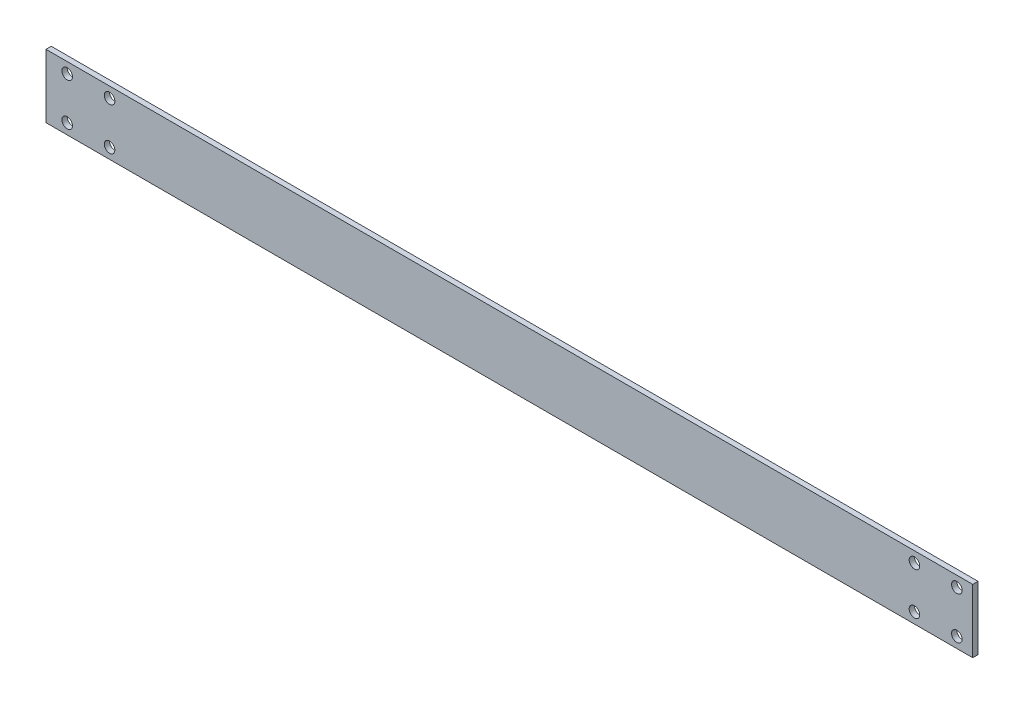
ISO-10303-21;
HEADER;
FILE_DESCRIPTION(('STEP AP214'),'2;1');
FILE_NAME('part.step','',(''),(''),'','','');
FILE_SCHEMA(('AUTOMOTIVE_DESIGN { 1 0 10303 214 1 1 1 1 }'));
ENDSEC;
DATA;
#1=APPLICATION_CONTEXT('core data for automotive mechanical design processes');
#2=APPLICATION_PROTOCOL_DEFINITION('international standard','automotive_design',2000,#1);
#3=PRODUCT_CONTEXT('',#1,'mechanical');
#4=PRODUCT('Part','Part','',(#3));
#5=PRODUCT_RELATED_PRODUCT_CATEGORY('part','',(#4));
#6=PRODUCT_DEFINITION_FORMATION('','',#4);
#7=PRODUCT_DEFINITION_CONTEXT('part definition',#1,'design');
#8=PRODUCT_DEFINITION('design','',#6,#7);
#9=PRODUCT_DEFINITION_SHAPE('','',#8);
#10=(LENGTH_UNIT() NAMED_UNIT(*) SI_UNIT(.MILLI.,.METRE.));
#11=(NAMED_UNIT(*) PLANE_ANGLE_UNIT() SI_UNIT($,.RADIAN.));
#12=(NAMED_UNIT(*) SI_UNIT($,.STERADIAN.) SOLID_ANGLE_UNIT());
#13=UNCERTAINTY_MEASURE_WITH_UNIT(LENGTH_MEASURE(1.E-05),#10,'distance_accuracy_value','');
#14=(GEOMETRIC_REPRESENTATION_CONTEXT(3) GLOBAL_UNCERTAINTY_ASSIGNED_CONTEXT((#13)) GLOBAL_UNIT_ASSIGNED_CONTEXT((#10,
#11,#12)) REPRESENTATION_CONTEXT('',''));
#15=CARTESIAN_POINT('',(0.,0.,0.));
#16=DIRECTION('',(0.,0.,1.));
#17=DIRECTION('',(1.,0.,0.));
#18=AXIS2_PLACEMENT_3D('',#15,#16,#17);
#19=CARTESIAN_POINT('',(0.,0.,2.));
#20=DIRECTION('',(0.,0.,-1.));
#21=DIRECTION('',(-1.,0.,0.));
#22=AXIS2_PLACEMENT_3D('',#19,#20,#21);
#23=PLANE('',#22);
#24=DIRECTION('',(0.,-1.,0.));
#25=VECTOR('',#24,1.);
#26=CARTESIAN_POINT('',(0.,0.,2.));
#27=LINE('',#26,#25);
#28=CARTESIAN_POINT('',(0.,24.,2.));
#29=VERTEX_POINT('',#28);
#30=CARTESIAN_POINT('',(0.,0.,2.));
#31=VERTEX_POINT('',#30);
#32=EDGE_CURVE('E85',#29,#31,#27,.T.);
#33=ORIENTED_EDGE('',*,*,#32,.T.);
#34=DIRECTION('',(1.,0.,0.));
#35=VECTOR('',#34,1.);
#36=CARTESIAN_POINT('',(0.,0.,2.));
#37=LINE('',#36,#35);
#38=CARTESIAN_POINT('',(350.,0.,2.));
#39=VERTEX_POINT('',#38);
#40=EDGE_CURVE('E80',#31,#39,#37,.T.);
#41=ORIENTED_EDGE('',*,*,#40,.T.);
#42=DIRECTION('',(0.,1.,0.));
#43=VECTOR('',#42,1.);
#44=CARTESIAN_POINT('',(350.,0.,2.));
#45=LINE('',#44,#43);
#46=CARTESIAN_POINT('',(350.,24.0000000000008,2.));
#47=VERTEX_POINT('',#46);
#48=EDGE_CURVE('E83',#39,#47,#45,.T.);
#49=ORIENTED_EDGE('',*,*,#48,.T.);
#50=DIRECTION('',(-1.,0.,0.));
#51=VECTOR('',#50,1.);
#52=CARTESIAN_POINT('',(0.,24.,2.));
#53=LINE('',#52,#51);
#54=EDGE_CURVE('E50',#47,#29,#53,.T.);
#55=ORIENTED_EDGE('',*,*,#54,.T.);
#56=EDGE_LOOP('',(#33,#41,#49,#55));
#57=FACE_BOUND('',#56,.T.);
#58=CARTESIAN_POINT('',(8.,20.,2.));
#59=DIRECTION('',(0.,0.,1.));
#60=DIRECTION('',(1.,0.,0.));
#61=AXIS2_PLACEMENT_3D('',#58,#59,#60);
#62=CIRCLE('',#61,2.);
#63=CARTESIAN_POINT('',(10.,20.,2.));
#64=VERTEX_POINT('',#63);
#65=EDGE_CURVE('E100',#64,#64,#62,.T.);
#66=ORIENTED_EDGE('',*,*,#65,.F.);
#67=EDGE_LOOP('',(#66));
#68=FACE_BOUND('',#67,.T.);
#69=CARTESIAN_POINT('',(24.,20.,2.));
#70=DIRECTION('',(0.,0.,1.));
#71=DIRECTION('',(1.,0.,0.));
#72=AXIS2_PLACEMENT_3D('',#69,#70,#71);
#73=CIRCLE('',#72,2.);
#74=CARTESIAN_POINT('',(26.,20.,2.));
#75=VERTEX_POINT('',#74);
#76=EDGE_CURVE('E115',#75,#75,#73,.T.);
#77=ORIENTED_EDGE('',*,*,#76,.F.);
#78=EDGE_LOOP('',(#77));
#79=FACE_BOUND('',#78,.T.);
#80=CARTESIAN_POINT('',(24.0000000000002,4.,2.));
#81=DIRECTION('',(0.,0.,1.));
#82=DIRECTION('',(1.,0.,0.));
#83=AXIS2_PLACEMENT_3D('',#80,#81,#82);
#84=CIRCLE('',#83,2.);
#85=CARTESIAN_POINT('',(26.0000000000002,4.,2.));
#86=VERTEX_POINT('',#85);
#87=EDGE_CURVE('E121',#86,#86,#84,.T.);
#88=ORIENTED_EDGE('',*,*,#87,.F.);
#89=EDGE_LOOP('',(#88));
#90=FACE_BOUND('',#89,.T.);
#91=CARTESIAN_POINT('',(8.00000000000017,4.,2.));
#92=DIRECTION('',(0.,0.,1.));
#93=DIRECTION('',(1.,0.,0.));
#94=AXIS2_PLACEMENT_3D('',#91,#92,#93);
#95=CIRCLE('',#94,2.);
#96=CARTESIAN_POINT('',(10.0000000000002,4.,2.));
#97=VERTEX_POINT('',#96);
#98=EDGE_CURVE('E127',#97,#97,#95,.T.);
#99=ORIENTED_EDGE('',*,*,#98,.F.);
#100=EDGE_LOOP('',(#99));
#101=FACE_BOUND('',#100,.T.);
#102=CARTESIAN_POINT('',(344.,4.00000000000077,2.));
#103=DIRECTION('',(0.,0.,1.));
#104=DIRECTION('',(-1.,0.,0.));
#105=AXIS2_PLACEMENT_3D('',#102,#103,#104);
#106=CIRCLE('',#105,2.);
#107=CARTESIAN_POINT('',(342.,4.00000000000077,2.));
#108=VERTEX_POINT('',#107);
#109=EDGE_CURVE('E133',#108,#108,#106,.T.);
#110=ORIENTED_EDGE('',*,*,#109,.F.);
#111=EDGE_LOOP('',(#110));
#112=FACE_BOUND('',#111,.T.);
#113=CARTESIAN_POINT('',(328.,4.00000000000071,2.));
#114=DIRECTION('',(0.,0.,1.));
#115=DIRECTION('',(-1.,0.,0.));
#116=AXIS2_PLACEMENT_3D('',#113,#114,#115);
#117=CIRCLE('',#116,2.);
#118=CARTESIAN_POINT('',(326.,4.00000000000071,2.));
#119=VERTEX_POINT('',#118);
#120=EDGE_CURVE('E139',#119,#119,#117,.T.);
#121=ORIENTED_EDGE('',*,*,#120,.F.);
#122=EDGE_LOOP('',(#121));
#123=FACE_BOUND('',#122,.T.);
#124=CARTESIAN_POINT('',(328.,20.0000000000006,2.));
#125=DIRECTION('',(0.,0.,1.));
#126=DIRECTION('',(-1.,0.,0.));
#127=AXIS2_PLACEMENT_3D('',#124,#125,#126);
#128=CIRCLE('',#127,2.);
#129=CARTESIAN_POINT('',(326.,20.0000000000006,2.));
#130=VERTEX_POINT('',#129);
#131=EDGE_CURVE('E145',#130,#130,#128,.T.);
#132=ORIENTED_EDGE('',*,*,#131,.F.);
#133=EDGE_LOOP('',(#132));
#134=FACE_BOUND('',#133,.T.);
#135=CARTESIAN_POINT('',(344.,20.,2.));
#136=DIRECTION('',(0.,0.,1.));
#137=DIRECTION('',(-1.,0.,0.));
#138=AXIS2_PLACEMENT_3D('',#135,#136,#137);
#139=CIRCLE('',#138,2.);
#140=CARTESIAN_POINT('',(342.,20.,2.));
#141=VERTEX_POINT('',#140);
#142=EDGE_CURVE('E151',#141,#141,#139,.T.);
#143=ORIENTED_EDGE('',*,*,#142,.F.);
#144=EDGE_LOOP('',(#143));
#145=FACE_BOUND('',#144,.T.);
#146=ADVANCED_FACE('F33',(#57,#68,#79,#90,#101,#112,#123,#134,#145),#23,.F.);
#147=CARTESIAN_POINT('',(0.,0.,0.));
#148=DIRECTION('',(0.,0.,-1.));
#149=DIRECTION('',(-1.,0.,0.));
#150=AXIS2_PLACEMENT_3D('',#147,#148,#149);
#151=PLANE('',#150);
#152=CARTESIAN_POINT('',(328.,20.0000000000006,0.));
#153=DIRECTION('',(0.,0.,1.));
#154=DIRECTION('',(-1.,0.,0.));
#155=AXIS2_PLACEMENT_3D('',#152,#153,#154);
#156=CIRCLE('',#155,2.);
#157=CARTESIAN_POINT('',(326.,20.0000000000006,0.));
#158=VERTEX_POINT('',#157);
#159=EDGE_CURVE('E148',#158,#158,#156,.T.);
#160=ORIENTED_EDGE('',*,*,#159,.T.);
#161=EDGE_LOOP('',(#160));
#162=FACE_BOUND('',#161,.T.);
#163=CARTESIAN_POINT('',(344.,4.00000000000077,0.));
#164=DIRECTION('',(0.,0.,1.));
#165=DIRECTION('',(-1.,0.,0.));
#166=AXIS2_PLACEMENT_3D('',#163,#164,#165);
#167=CIRCLE('',#166,2.);
#168=CARTESIAN_POINT('',(342.,4.00000000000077,0.));
#169=VERTEX_POINT('',#168);
#170=EDGE_CURVE('E136',#169,#169,#167,.T.);
#171=ORIENTED_EDGE('',*,*,#170,.T.);
#172=EDGE_LOOP('',(#171));
#173=FACE_BOUND('',#172,.T.);
#174=CARTESIAN_POINT('',(24.0000000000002,4.,0.));
#175=DIRECTION('',(0.,0.,1.));
#176=DIRECTION('',(1.,0.,0.));
#177=AXIS2_PLACEMENT_3D('',#174,#175,#176);
#178=CIRCLE('',#177,2.);
#179=CARTESIAN_POINT('',(26.0000000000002,4.,0.));
#180=VERTEX_POINT('',#179);
#181=EDGE_CURVE('E124',#180,#180,#178,.T.);
#182=ORIENTED_EDGE('',*,*,#181,.T.);
#183=EDGE_LOOP('',(#182));
#184=FACE_BOUND('',#183,.T.);
#185=CARTESIAN_POINT('',(8.,20.,0.));
#186=DIRECTION('',(0.,0.,1.));
#187=DIRECTION('',(1.,0.,0.));
#188=AXIS2_PLACEMENT_3D('',#185,#186,#187);
#189=CIRCLE('',#188,2.);
#190=CARTESIAN_POINT('',(10.,20.,0.));
#191=VERTEX_POINT('',#190);
#192=EDGE_CURVE('E112',#191,#191,#189,.T.);
#193=ORIENTED_EDGE('',*,*,#192,.T.);
#194=EDGE_LOOP('',(#193));
#195=FACE_BOUND('',#194,.T.);
#196=DIRECTION('',(0.,-1.,0.));
#197=VECTOR('',#196,1.);
#198=CARTESIAN_POINT('',(0.,0.,0.));
#199=LINE('',#198,#197);
#200=CARTESIAN_POINT('',(0.,24.,0.));
#201=VERTEX_POINT('',#200);
#202=CARTESIAN_POINT('',(0.,0.,0.));
#203=VERTEX_POINT('',#202);
#204=EDGE_CURVE('E97',#201,#203,#199,.T.);
#205=ORIENTED_EDGE('',*,*,#204,.F.);
#206=DIRECTION('',(-1.,0.,0.));
#207=VECTOR('',#206,1.);
#208=CARTESIAN_POINT('',(0.,24.,0.));
#209=LINE('',#208,#207);
#210=CARTESIAN_POINT('',(350.,24.0000000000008,0.));
#211=VERTEX_POINT('',#210);
#212=EDGE_CURVE('E73',#211,#201,#209,.T.);
#213=ORIENTED_EDGE('',*,*,#212,.F.);
#214=DIRECTION('',(0.,1.,0.));
#215=VECTOR('',#214,1.);
#216=CARTESIAN_POINT('',(350.,0.,0.));
#217=LINE('',#216,#215);
#218=CARTESIAN_POINT('',(350.,0.,0.));
#219=VERTEX_POINT('',#218);
#220=EDGE_CURVE('E67',#219,#211,#217,.T.);
#221=ORIENTED_EDGE('',*,*,#220,.F.);
#222=DIRECTION('',(1.,0.,0.));
#223=VECTOR('',#222,1.);
#224=CARTESIAN_POINT('',(0.,0.,0.));
#225=LINE('',#224,#223);
#226=EDGE_CURVE('E89',#203,#219,#225,.T.);
#227=ORIENTED_EDGE('',*,*,#226,.F.);
#228=EDGE_LOOP('',(#205,#213,#221,#227));
#229=FACE_BOUND('',#228,.T.);
#230=CARTESIAN_POINT('',(24.,20.,0.));
#231=DIRECTION('',(0.,0.,1.));
#232=DIRECTION('',(1.,0.,0.));
#233=AXIS2_PLACEMENT_3D('',#230,#231,#232);
#234=CIRCLE('',#233,2.);
#235=CARTESIAN_POINT('',(26.,20.,0.));
#236=VERTEX_POINT('',#235);
#237=EDGE_CURVE('E118',#236,#236,#234,.T.);
#238=ORIENTED_EDGE('',*,*,#237,.T.);
#239=EDGE_LOOP('',(#238));
#240=FACE_BOUND('',#239,.T.);
#241=CARTESIAN_POINT('',(8.00000000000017,4.,0.));
#242=DIRECTION('',(0.,0.,1.));
#243=DIRECTION('',(1.,0.,0.));
#244=AXIS2_PLACEMENT_3D('',#241,#242,#243);
#245=CIRCLE('',#244,2.);
#246=CARTESIAN_POINT('',(10.0000000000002,4.,0.));
#247=VERTEX_POINT('',#246);
#248=EDGE_CURVE('E130',#247,#247,#245,.T.);
#249=ORIENTED_EDGE('',*,*,#248,.T.);
#250=EDGE_LOOP('',(#249));
#251=FACE_BOUND('',#250,.T.);
#252=CARTESIAN_POINT('',(328.,4.00000000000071,0.));
#253=DIRECTION('',(0.,0.,1.));
#254=DIRECTION('',(-1.,0.,0.));
#255=AXIS2_PLACEMENT_3D('',#252,#253,#254);
#256=CIRCLE('',#255,2.);
#257=CARTESIAN_POINT('',(326.,4.00000000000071,0.));
#258=VERTEX_POINT('',#257);
#259=EDGE_CURVE('E142',#258,#258,#256,.T.);
#260=ORIENTED_EDGE('',*,*,#259,.T.);
#261=EDGE_LOOP('',(#260));
#262=FACE_BOUND('',#261,.T.);
#263=CARTESIAN_POINT('',(344.,20.,0.));
#264=DIRECTION('',(0.,0.,1.));
#265=DIRECTION('',(-1.,0.,0.));
#266=AXIS2_PLACEMENT_3D('',#263,#264,#265);
#267=CIRCLE('',#266,2.);
#268=CARTESIAN_POINT('',(342.,20.,0.));
#269=VERTEX_POINT('',#268);
#270=EDGE_CURVE('E154',#269,#269,#267,.T.);
#271=ORIENTED_EDGE('',*,*,#270,.T.);
#272=EDGE_LOOP('',(#271));
#273=FACE_BOUND('',#272,.T.);
#274=ADVANCED_FACE('F108',(#162,#173,#184,#195,#229,#240,#251,#262,#273),#151,.T.);
#275=CARTESIAN_POINT('',(0.,0.,2.));
#276=DIRECTION('',(1.,0.,0.));
#277=DIRECTION('',(0.,0.,-1.));
#278=AXIS2_PLACEMENT_3D('',#275,#276,#277);
#279=PLANE('',#278);
#280=ORIENTED_EDGE('',*,*,#204,.T.);
#281=DIRECTION('',(0.,0.,-1.));
#282=VECTOR('',#281,1.);
#283=CARTESIAN_POINT('',(0.,0.,2.));
#284=LINE('',#283,#282);
#285=EDGE_CURVE('E11',#31,#203,#284,.T.);
#286=ORIENTED_EDGE('',*,*,#285,.F.);
#287=ORIENTED_EDGE('',*,*,#32,.F.);
#288=DIRECTION('',(0.,0.,-1.));
#289=VECTOR('',#288,1.);
#290=CARTESIAN_POINT('',(0.,24.,2.));
#291=LINE('',#290,#289);
#292=EDGE_CURVE('E93',#29,#201,#291,.T.);
#293=ORIENTED_EDGE('',*,*,#292,.T.);
#294=EDGE_LOOP('',(#280,#286,#287,#293));
#295=FACE_BOUND('',#294,.T.);
#296=ADVANCED_FACE('F35',(#295),#279,.F.);
#297=CARTESIAN_POINT('',(0.,0.,2.));
#298=DIRECTION('',(0.,1.,0.));
#299=DIRECTION('',(0.,0.,1.));
#300=AXIS2_PLACEMENT_3D('',#297,#298,#299);
#301=PLANE('',#300);
#302=ORIENTED_EDGE('',*,*,#226,.T.);
#303=DIRECTION('',(0.,0.,-1.));
#304=VECTOR('',#303,1.);
#305=CARTESIAN_POINT('',(350.,0.,2.));
#306=LINE('',#305,#304);
#307=EDGE_CURVE('E42',#39,#219,#306,.T.);
#308=ORIENTED_EDGE('',*,*,#307,.F.);
#309=ORIENTED_EDGE('',*,*,#40,.F.);
#310=ORIENTED_EDGE('',*,*,#285,.T.);
#311=EDGE_LOOP('',(#302,#308,#309,#310));
#312=FACE_BOUND('',#311,.T.);
#313=ADVANCED_FACE('F88',(#312),#301,.F.);
#314=CARTESIAN_POINT('',(350.,0.,2.));
#315=DIRECTION('',(-1.,0.,0.));
#316=DIRECTION('',(0.,0.,1.));
#317=AXIS2_PLACEMENT_3D('',#314,#315,#316);
#318=PLANE('',#317);
#319=ORIENTED_EDGE('',*,*,#220,.T.);
#320=DIRECTION('',(0.,0.,-1.));
#321=VECTOR('',#320,1.);
#322=CARTESIAN_POINT('',(350.,24.0000000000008,2.));
#323=LINE('',#322,#321);
#324=EDGE_CURVE('E90',#47,#211,#323,.T.);
#325=ORIENTED_EDGE('',*,*,#324,.F.);
#326=ORIENTED_EDGE('',*,*,#48,.F.);
#327=ORIENTED_EDGE('',*,*,#307,.T.);
#328=EDGE_LOOP('',(#319,#325,#326,#327));
#329=FACE_BOUND('',#328,.T.);
#330=ADVANCED_FACE('F91',(#329),#318,.F.);
#331=CARTESIAN_POINT('',(0.,24.,2.));
#332=DIRECTION('',(0.,-1.,0.));
#333=DIRECTION('',(1.,0.,0.));
#334=AXIS2_PLACEMENT_3D('',#331,#332,#333);
#335=PLANE('',#334);
#336=ORIENTED_EDGE('',*,*,#212,.T.);
#337=ORIENTED_EDGE('',*,*,#292,.F.);
#338=ORIENTED_EDGE('',*,*,#54,.F.);
#339=ORIENTED_EDGE('',*,*,#324,.T.);
#340=EDGE_LOOP('',(#336,#337,#338,#339));
#341=FACE_BOUND('',#340,.T.);
#342=ADVANCED_FACE('F105',(#341),#335,.F.);
#343=CARTESIAN_POINT('',(8.,20.,2.));
#344=DIRECTION('',(0.,0.,-1.));
#345=DIRECTION('',(-1.,0.,0.));
#346=AXIS2_PLACEMENT_3D('',#343,#344,#345);
#347=CYLINDRICAL_SURFACE('',#346,2.);
#348=ORIENTED_EDGE('',*,*,#65,.T.);
#349=EDGE_LOOP('',(#348));
#350=FACE_BOUND('',#349,.T.);
#351=ORIENTED_EDGE('',*,*,#192,.F.);
#352=EDGE_LOOP('',(#351));
#353=FACE_BOUND('',#352,.T.);
#354=ADVANCED_FACE('F171',(#350,#353),#347,.F.);
#355=CARTESIAN_POINT('',(24.,20.,2.));
#356=DIRECTION('',(0.,0.,-1.));
#357=DIRECTION('',(-1.,0.,0.));
#358=AXIS2_PLACEMENT_3D('',#355,#356,#357);
#359=CYLINDRICAL_SURFACE('',#358,2.);
#360=ORIENTED_EDGE('',*,*,#76,.T.);
#361=EDGE_LOOP('',(#360));
#362=FACE_BOUND('',#361,.T.);
#363=ORIENTED_EDGE('',*,*,#237,.F.);
#364=EDGE_LOOP('',(#363));
#365=FACE_BOUND('',#364,.T.);
#366=ADVANCED_FACE('F217',(#362,#365),#359,.F.);
#367=CARTESIAN_POINT('',(24.0000000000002,4.,2.));
#368=DIRECTION('',(0.,0.,-1.));
#369=DIRECTION('',(-1.,0.,0.));
#370=AXIS2_PLACEMENT_3D('',#367,#368,#369);
#371=CYLINDRICAL_SURFACE('',#370,2.);
#372=ORIENTED_EDGE('',*,*,#87,.T.);
#373=EDGE_LOOP('',(#372));
#374=FACE_BOUND('',#373,.T.);
#375=ORIENTED_EDGE('',*,*,#181,.F.);
#376=EDGE_LOOP('',(#375));
#377=FACE_BOUND('',#376,.T.);
#378=ADVANCED_FACE('F225',(#374,#377),#371,.F.);
#379=CARTESIAN_POINT('',(8.00000000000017,4.,2.));
#380=DIRECTION('',(0.,0.,-1.));
#381=DIRECTION('',(-1.,0.,0.));
#382=AXIS2_PLACEMENT_3D('',#379,#380,#381);
#383=CYLINDRICAL_SURFACE('',#382,2.);
#384=ORIENTED_EDGE('',*,*,#98,.T.);
#385=EDGE_LOOP('',(#384));
#386=FACE_BOUND('',#385,.T.);
#387=ORIENTED_EDGE('',*,*,#248,.F.);
#388=EDGE_LOOP('',(#387));
#389=FACE_BOUND('',#388,.T.);
#390=ADVANCED_FACE('F233',(#386,#389),#383,.F.);
#391=CARTESIAN_POINT('',(344.,4.00000000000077,2.));
#392=DIRECTION('',(0.,0.,-1.));
#393=DIRECTION('',(-1.,0.,0.));
#394=AXIS2_PLACEMENT_3D('',#391,#392,#393);
#395=CYLINDRICAL_SURFACE('',#394,2.);
#396=ORIENTED_EDGE('',*,*,#109,.T.);
#397=EDGE_LOOP('',(#396));
#398=FACE_BOUND('',#397,.T.);
#399=ORIENTED_EDGE('',*,*,#170,.F.);
#400=EDGE_LOOP('',(#399));
#401=FACE_BOUND('',#400,.T.);
#402=ADVANCED_FACE('F242',(#398,#401),#395,.F.);
#403=CARTESIAN_POINT('',(328.,4.00000000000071,2.));
#404=DIRECTION('',(0.,0.,-1.));
#405=DIRECTION('',(-1.,0.,0.));
#406=AXIS2_PLACEMENT_3D('',#403,#404,#405);
#407=CYLINDRICAL_SURFACE('',#406,2.);
#408=ORIENTED_EDGE('',*,*,#120,.T.);
#409=EDGE_LOOP('',(#408));
#410=FACE_BOUND('',#409,.T.);
#411=ORIENTED_EDGE('',*,*,#259,.F.);
#412=EDGE_LOOP('',(#411));
#413=FACE_BOUND('',#412,.T.);
#414=ADVANCED_FACE('F251',(#410,#413),#407,.F.);
#415=CARTESIAN_POINT('',(328.,20.0000000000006,2.));
#416=DIRECTION('',(0.,0.,-1.));
#417=DIRECTION('',(-1.,0.,0.));
#418=AXIS2_PLACEMENT_3D('',#415,#416,#417);
#419=CYLINDRICAL_SURFACE('',#418,2.);
#420=ORIENTED_EDGE('',*,*,#131,.T.);
#421=EDGE_LOOP('',(#420));
#422=FACE_BOUND('',#421,.T.);
#423=ORIENTED_EDGE('',*,*,#159,.F.);
#424=EDGE_LOOP('',(#423));
#425=FACE_BOUND('',#424,.T.);
#426=ADVANCED_FACE('F260',(#422,#425),#419,.F.);
#427=CARTESIAN_POINT('',(344.,20.,2.));
#428=DIRECTION('',(0.,0.,-1.));
#429=DIRECTION('',(-1.,0.,0.));
#430=AXIS2_PLACEMENT_3D('',#427,#428,#429);
#431=CYLINDRICAL_SURFACE('',#430,2.);
#432=ORIENTED_EDGE('',*,*,#142,.T.);
#433=EDGE_LOOP('',(#432));
#434=FACE_BOUND('',#433,.T.);
#435=ORIENTED_EDGE('',*,*,#270,.F.);
#436=EDGE_LOOP('',(#435));
#437=FACE_BOUND('',#436,.T.);
#438=ADVANCED_FACE('F160',(#434,#437),#431,.F.);
#439=CLOSED_SHELL('',(#146,#274,#296,#313,#330,#342,#354,#366,#378,#390,#402,#414,#426,#438));
#440=MANIFOLD_SOLID_BREP('B2',#439);
#441=ADVANCED_BREP_SHAPE_REPRESENTATION('',(#18,#440),#14);
#442=SHAPE_DEFINITION_REPRESENTATION(#9,#441);
ENDSEC;
END-ISO-10303-21;
